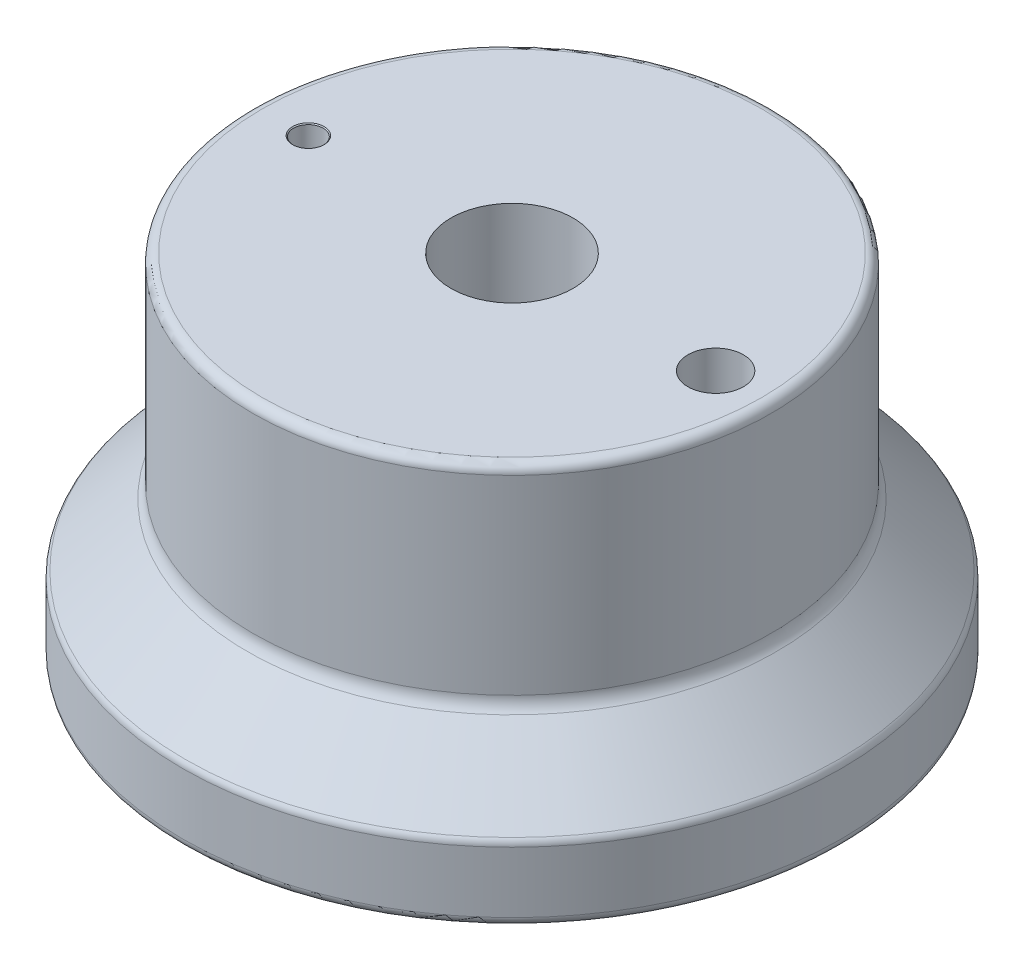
from build123d import *

# Parameters (mm, degrees)
M4X0_7_TAPPED_HOLE1_D     = 3.3
M4X0_7_TAPPED_HOLE1_DEPTH = 6
M4X0_7_TAPPED_HOLE1_TIP   = 0.991420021
FILLET1_R                 = 0.25
FILLET2_R                 = 0.5
F_1_5MM_DOWEL_HOLE1_D     = 1.5
F_1_5MM_DOWEL_HOLE1_DEPTH = 3.5
F_1_5MM_DOWEL_HOLE1_TIP   = 0.75


with BuildPart() as part:
    # Sketch1 → Revolve1 (revolve)
    with BuildSketch(Plane.XY, mode=Mode.PRIVATE) as revolve1_sk:
        Polygon((0, 0), (0, 9.5), (7, 9.5), (7, 3.9), (8.9, 2), (8.9, 0), align=None)
    revolve(revolve1_sk.sketch.rotate(Axis((0, 0, 0), (0, 1, 0)), 90), axis=Axis((0, 0, 0), (0, 1, 0)))

    # Sketch2 → 0.8 _0.8_ Diameter Hole1 (revolve, cut)
    with BuildSketch(Plane(origin=(-5.5, 0, 0), x_dir=(0, 0, -1), z_dir=(1, 0, 0))):
        Polygon((0, 0), (0, 9.5), (0.425, 9.5), (0.4, 9.475), (0.4, 0.014433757), (0.425, 0), align=None)
    revolve(axis=Axis((-5.5, -6.35, 0), (0, 1, 0)), mode=Mode.SUBTRACT)

    # M4x0.7 Tapped Hole1
    with Locations(Plane(origin=(0, 9.5, 0), x_dir=(-1, 0, 0), z_dir=(0, 1, 0))):
        with Locations((0, 0)):
            Hole(M4X0_7_TAPPED_HOLE1_D / 2, depth=M4X0_7_TAPPED_HOLE1_DEPTH)
            with Locations((0, 0, -(M4X0_7_TAPPED_HOLE1_DEPTH + M4X0_7_TAPPED_HOLE1_TIP / 2))):  # 118° drill point
                Cone(0, M4X0_7_TAPPED_HOLE1_D / 2, M4X0_7_TAPPED_HOLE1_TIP, mode=Mode.SUBTRACT)

    # Fillet1
    fillet1_edges = [part.edges().sort_by_distance(p)[0] for p in [
        (0, 0, 8.9),
        (0, 2, 8.9),
        (0, 9.5, 7),
    ]]
    fillet(fillet1_edges, radius=FILLET1_R)

    # Fillet2
    fillet2_edges = [part.edges().sort_by_distance(p)[0] for p in [
        (0, 3.9, 7),
    ]]
    fillet(fillet2_edges, radius=FILLET2_R)

    # 1.5mm Dowel Hole1
    with Locations(Plane(origin=(0, 9.5, 0), x_dir=(1, 0, 0), z_dir=(0, 1, 0))):
        with Locations((5.5, 0)):
            Hole(F_1_5MM_DOWEL_HOLE1_D / 2, depth=F_1_5MM_DOWEL_HOLE1_DEPTH)
            with Locations((0, 0, -(F_1_5MM_DOWEL_HOLE1_DEPTH + F_1_5MM_DOWEL_HOLE1_TIP / 2))):  # 90° drill point
                Cone(0, F_1_5MM_DOWEL_HOLE1_D / 2, F_1_5MM_DOWEL_HOLE1_TIP, mode=Mode.SUBTRACT)


solid = part.part
